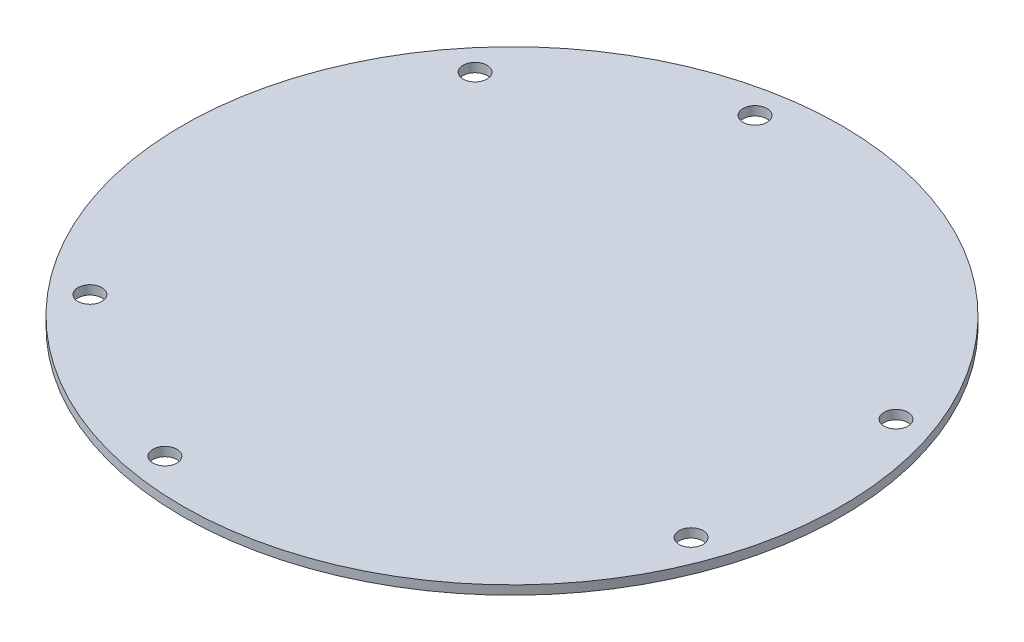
from build123d import *

# Parameters (mm, degrees)
SKETCH_1_W               = 1100
SKETCH_1_H               = 30
SKETCH_2_R               = 40
CUT_EXTRUDE_1_DEPTH      = 1556.924162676
PATTERN_CIRCULAR_1_COUNT = 3
SKETCH_3_R               = 40
CUT_EXTRUDE_2_DEPTH      = 1556.924162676
PATTERN_CIRCULAR_2_COUNT = 3


with BuildPart() as part:
    # Sketch 1 → Revolve 1 (revolve)
    with BuildSketch(Plane.XY, mode=Mode.PRIVATE) as revolve_1_sk:
        with Locations((550, 15)):
            Rectangle(SKETCH_1_W, SKETCH_1_H)
    revolve(revolve_1_sk.sketch.rotate(Axis((0, -34.978212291, 0), (0, 1, 0)), 90), axis=Axis((0, -34.978212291, 0), (0, 1, 0)))

    # Sketch 2 → Cut-Extrude 1 (cut, through all)
    with BuildSketch(Plane(origin=(0, 30, 0), x_dir=(1, 0, 0), z_dir=(0, 1, 0))):
        with Locations(Location((939.692620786, 342.020143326, 0), (0, 0, 270))):
            Circle(SKETCH_2_R)
    cut_extrude_1 = extrude(amount=-CUT_EXTRUDE_1_DEPTH, mode=Mode.SUBTRACT)

    # Pattern Circular 1: Cut-Extrude 1 ×3 about axis
    pattern_circular_1_axis = Axis((0, 0, 0), (0, 1, 0))
    for i in range(1, PATTERN_CIRCULAR_1_COUNT):
        add(cut_extrude_1.rotate(pattern_circular_1_axis, i * 360 / PATTERN_CIRCULAR_1_COUNT), mode=Mode.SUBTRACT)

    # Sketch 3 → Cut-Extrude 2 (cut, through all)
    with BuildSketch(Plane(origin=(0, 30, 0), x_dir=(1, 0, 0), z_dir=(0, 1, 0))):
        with Locations(Location((-173.648177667, 984.807753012, 0), (0, 0, 270))):
            Circle(SKETCH_3_R)
    cut_extrude_2 = extrude(amount=-CUT_EXTRUDE_2_DEPTH, mode=Mode.SUBTRACT)

    # Pattern Circular 2: Cut-Extrude 2 ×3 about axis
    pattern_circular_2_axis = Axis((0, 0, 0), (0, 1, 0))
    for i in range(1, PATTERN_CIRCULAR_2_COUNT):
        add(cut_extrude_2.rotate(pattern_circular_2_axis, i * 360 / PATTERN_CIRCULAR_2_COUNT), mode=Mode.SUBTRACT)


solid = part.part
